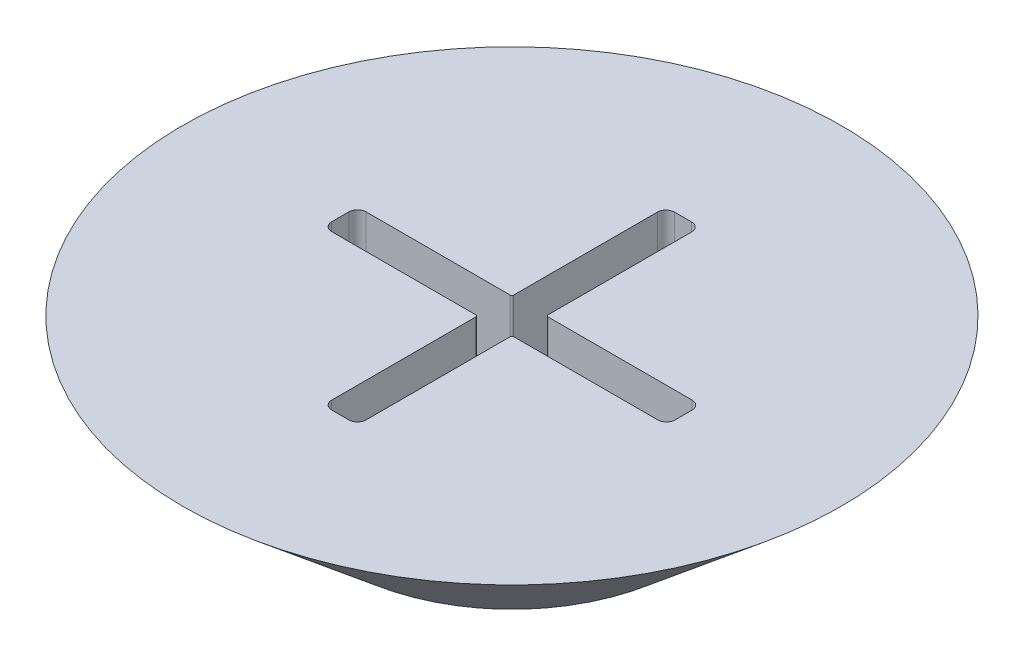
ISO-10303-21;
HEADER;
FILE_DESCRIPTION(('STEP AP214'),'2;1');
FILE_NAME('part.step','',(''),(''),'','','');
FILE_SCHEMA(('AUTOMOTIVE_DESIGN { 1 0 10303 214 1 1 1 1 }'));
ENDSEC;
DATA;
#1=APPLICATION_CONTEXT('core data for automotive mechanical design processes');
#2=APPLICATION_PROTOCOL_DEFINITION('international standard','automotive_design',2000,#1);
#3=PRODUCT_CONTEXT('',#1,'mechanical');
#4=PRODUCT('Part','Part','',(#3));
#5=PRODUCT_RELATED_PRODUCT_CATEGORY('part','',(#4));
#6=PRODUCT_DEFINITION_FORMATION('','',#4);
#7=PRODUCT_DEFINITION_CONTEXT('part definition',#1,'design');
#8=PRODUCT_DEFINITION('design','',#6,#7);
#9=PRODUCT_DEFINITION_SHAPE('','',#8);
#10=(LENGTH_UNIT() NAMED_UNIT(*) SI_UNIT(.MILLI.,.METRE.));
#11=(NAMED_UNIT(*) PLANE_ANGLE_UNIT() SI_UNIT($,.RADIAN.));
#12=(NAMED_UNIT(*) SI_UNIT($,.STERADIAN.) SOLID_ANGLE_UNIT());
#13=UNCERTAINTY_MEASURE_WITH_UNIT(LENGTH_MEASURE(1.E-05),#10,'distance_accuracy_value','');
#14=(GEOMETRIC_REPRESENTATION_CONTEXT(3) GLOBAL_UNCERTAINTY_ASSIGNED_CONTEXT((#13)) GLOBAL_UNIT_ASSIGNED_CONTEXT((#10,
#11,#12)) REPRESENTATION_CONTEXT('',''));
#15=CARTESIAN_POINT('',(0.,0.,0.));
#16=DIRECTION('',(0.,0.,1.));
#17=DIRECTION('',(1.,0.,0.));
#18=AXIS2_PLACEMENT_3D('',#15,#16,#17);
#19=CARTESIAN_POINT('',(-22.2852426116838,14.4740206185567,0.));
#20=DIRECTION('',(0.,1.,0.));
#21=DIRECTION('',(0.,0.,1.));
#22=AXIS2_PLACEMENT_3D('',#19,#20,#21);
#23=PLANE('',#22);
#24=CARTESIAN_POINT('',(-22.2852426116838,14.4740206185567,0.));
#25=DIRECTION('',(0.,1.,0.));
#26=DIRECTION('',(0.,0.,1.));
#27=AXIS2_PLACEMENT_3D('',#24,#25,#26);
#28=CIRCLE('',#27,2.5527);
#29=CARTESIAN_POINT('',(-22.2852426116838,14.4740206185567,2.5527));
#30=VERTEX_POINT('',#29);
#31=EDGE_CURVE('E24',#30,#30,#28,.T.);
#32=ORIENTED_EDGE('',*,*,#31,.F.);
#33=EDGE_LOOP('',(#32));
#34=FACE_BOUND('',#33,.T.);
#35=ADVANCED_FACE('F17',(#34),#23,.F.);
#36=CARTESIAN_POINT('',(-22.2852426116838,16.4298206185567,0.));
#37=DIRECTION('',(0.,-1.,0.));
#38=DIRECTION('',(0.,0.,-1.));
#39=AXIS2_PLACEMENT_3D('',#36,#37,#38);
#40=PLANE('',#39);
#41=DIRECTION('',(0.,0.,1.));
#42=VECTOR('',#41,1.);
#43=CARTESIAN_POINT('',(-22.5392426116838,16.4298206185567,-0.2794));
#44=LINE('',#43,#42);
#45=CARTESIAN_POINT('',(-22.5392426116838,16.4298206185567,-2.40566804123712));
#46=VERTEX_POINT('',#45);
#47=CARTESIAN_POINT('',(-22.5392426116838,16.4298206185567,-0.2794));
#48=VERTEX_POINT('',#47);
#49=EDGE_CURVE('E213',#46,#48,#44,.T.);
#50=ORIENTED_EDGE('',*,*,#49,.F.);
#51=CARTESIAN_POINT('',(-22.4122426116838,16.4298206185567,-2.40566804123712));
#52=DIRECTION('',(0.,1.,0.));
#53=DIRECTION('',(0.,0.,-1.));
#54=AXIS2_PLACEMENT_3D('',#51,#52,#53);
#55=CIRCLE('',#54,0.127);
#56=CARTESIAN_POINT('',(-22.4122426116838,16.4298206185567,-2.53266804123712));
#57=VERTEX_POINT('',#56);
#58=EDGE_CURVE('E31',#57,#46,#55,.T.);
#59=ORIENTED_EDGE('',*,*,#58,.F.);
#60=DIRECTION('',(-1.,0.,0.));
#61=VECTOR('',#60,1.);
#62=CARTESIAN_POINT('',(-22.4122426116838,16.4298206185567,-2.53266804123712));
#63=LINE('',#62,#61);
#64=CARTESIAN_POINT('',(-22.1582426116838,16.4298206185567,-2.53266804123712));
#65=VERTEX_POINT('',#64);
#66=EDGE_CURVE('E276',#65,#57,#63,.T.);
#67=ORIENTED_EDGE('',*,*,#66,.F.);
#68=CARTESIAN_POINT('',(-22.1582426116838,16.4298206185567,-2.40566804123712));
#69=DIRECTION('',(0.,1.,0.));
#70=DIRECTION('',(0.,0.,1.));
#71=AXIS2_PLACEMENT_3D('',#68,#69,#70);
#72=CIRCLE('',#71,0.127);
#73=CARTESIAN_POINT('',(-22.0312426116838,16.4298206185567,-2.40566804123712));
#74=VERTEX_POINT('',#73);
#75=EDGE_CURVE('E274',#74,#65,#72,.T.);
#76=ORIENTED_EDGE('',*,*,#75,.F.);
#77=DIRECTION('',(0.,0.,-1.));
#78=VECTOR('',#77,1.);
#79=CARTESIAN_POINT('',(-22.0312426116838,16.4298206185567,-0.2794));
#80=LINE('',#79,#78);
#81=CARTESIAN_POINT('',(-22.0312426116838,16.4298206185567,-0.2794));
#82=VERTEX_POINT('',#81);
#83=EDGE_CURVE('E187',#82,#74,#80,.T.);
#84=ORIENTED_EDGE('',*,*,#83,.F.);
#85=CARTESIAN_POINT('',(-22.0058426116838,16.4298206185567,-0.2794));
#86=DIRECTION('',(0.,-1.,0.));
#87=DIRECTION('',(0.,0.,1.));
#88=AXIS2_PLACEMENT_3D('',#85,#86,#87);
#89=CIRCLE('',#88,0.0253999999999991);
#90=CARTESIAN_POINT('',(-22.0058426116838,16.4298206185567,-0.254));
#91=VERTEX_POINT('',#90);
#92=EDGE_CURVE('E270',#91,#82,#89,.T.);
#93=ORIENTED_EDGE('',*,*,#92,.F.);
#94=DIRECTION('',(-1.,0.,0.));
#95=VECTOR('',#94,1.);
#96=CARTESIAN_POINT('',(-22.0058426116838,16.4298206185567,-0.254));
#97=LINE('',#96,#95);
#98=CARTESIAN_POINT('',(-19.8722426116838,16.4298206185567,-0.254));
#99=VERTEX_POINT('',#98);
#100=EDGE_CURVE('E267',#99,#91,#97,.T.);
#101=ORIENTED_EDGE('',*,*,#100,.F.);
#102=CARTESIAN_POINT('',(-19.8722426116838,16.4298206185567,-0.127));
#103=DIRECTION('',(0.,1.,0.));
#104=DIRECTION('',(0.,0.,-1.));
#105=AXIS2_PLACEMENT_3D('',#102,#103,#104);
#106=CIRCLE('',#105,0.127);
#107=CARTESIAN_POINT('',(-19.7452426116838,16.4298206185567,-0.126999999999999));
#108=VERTEX_POINT('',#107);
#109=EDGE_CURVE('E264',#108,#99,#106,.T.);
#110=ORIENTED_EDGE('',*,*,#109,.F.);
#111=DIRECTION('',(0.,0.,-1.));
#112=VECTOR('',#111,1.);
#113=CARTESIAN_POINT('',(-19.7452426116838,16.4298206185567,-0.126999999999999));
#114=LINE('',#113,#112);
#115=CARTESIAN_POINT('',(-19.7452426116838,16.4298206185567,0.126999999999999));
#116=VERTEX_POINT('',#115);
#117=EDGE_CURVE('E261',#116,#108,#114,.T.);
#118=ORIENTED_EDGE('',*,*,#117,.F.);
#119=CARTESIAN_POINT('',(-19.8722426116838,16.4298206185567,0.127));
#120=DIRECTION('',(0.,1.,0.));
#121=DIRECTION('',(0.,0.,-1.));
#122=AXIS2_PLACEMENT_3D('',#119,#120,#121);
#123=CIRCLE('',#122,0.127);
#124=CARTESIAN_POINT('',(-19.8722426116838,16.4298206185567,0.254));
#125=VERTEX_POINT('',#124);
#126=EDGE_CURVE('E258',#125,#116,#123,.T.);
#127=ORIENTED_EDGE('',*,*,#126,.F.);
#128=DIRECTION('',(1.,0.,0.));
#129=VECTOR('',#128,1.);
#130=CARTESIAN_POINT('',(-22.0058426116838,16.4298206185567,0.254));
#131=LINE('',#130,#129);
#132=CARTESIAN_POINT('',(-22.0058426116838,16.4298206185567,0.254000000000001));
#133=VERTEX_POINT('',#132);
#134=EDGE_CURVE('E255',#133,#125,#131,.T.);
#135=ORIENTED_EDGE('',*,*,#134,.F.);
#136=CARTESIAN_POINT('',(-22.0058426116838,16.4298206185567,0.2794));
#137=DIRECTION('',(0.,-1.,0.));
#138=DIRECTION('',(0.,0.,-1.));
#139=AXIS2_PLACEMENT_3D('',#136,#137,#138);
#140=CIRCLE('',#139,0.025399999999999);
#141=CARTESIAN_POINT('',(-22.0312426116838,16.4298206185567,0.2794));
#142=VERTEX_POINT('',#141);
#143=EDGE_CURVE('E252',#142,#133,#140,.T.);
#144=ORIENTED_EDGE('',*,*,#143,.F.);
#145=DIRECTION('',(0.,0.,-1.));
#146=VECTOR('',#145,1.);
#147=CARTESIAN_POINT('',(-22.0312426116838,16.4298206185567,0.2794));
#148=LINE('',#147,#146);
#149=CARTESIAN_POINT('',(-22.0312426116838,16.4298206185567,2.413));
#150=VERTEX_POINT('',#149);
#151=EDGE_CURVE('E249',#150,#142,#148,.T.);
#152=ORIENTED_EDGE('',*,*,#151,.F.);
#153=CARTESIAN_POINT('',(-22.1582426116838,16.4298206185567,2.413));
#154=DIRECTION('',(0.,1.,0.));
#155=DIRECTION('',(0.,0.,-1.));
#156=AXIS2_PLACEMENT_3D('',#153,#154,#155);
#157=CIRCLE('',#156,0.126999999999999);
#158=CARTESIAN_POINT('',(-22.1582426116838,16.4298206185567,2.54));
#159=VERTEX_POINT('',#158);
#160=EDGE_CURVE('E246',#159,#150,#157,.T.);
#161=ORIENTED_EDGE('',*,*,#160,.F.);
#162=DIRECTION('',(1.,0.,0.));
#163=VECTOR('',#162,1.);
#164=CARTESIAN_POINT('',(-22.4122426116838,16.4298206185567,2.54));
#165=LINE('',#164,#163);
#166=CARTESIAN_POINT('',(-22.4122426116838,16.4298206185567,2.54));
#167=VERTEX_POINT('',#166);
#168=EDGE_CURVE('E243',#167,#159,#165,.T.);
#169=ORIENTED_EDGE('',*,*,#168,.F.);
#170=CARTESIAN_POINT('',(-22.4122426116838,16.4298206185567,2.413));
#171=DIRECTION('',(0.,1.,0.));
#172=DIRECTION('',(0.,0.,-1.));
#173=AXIS2_PLACEMENT_3D('',#170,#171,#172);
#174=CIRCLE('',#173,0.126999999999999);
#175=CARTESIAN_POINT('',(-22.5392426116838,16.4298206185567,2.413));
#176=VERTEX_POINT('',#175);
#177=EDGE_CURVE('E240',#176,#167,#174,.T.);
#178=ORIENTED_EDGE('',*,*,#177,.F.);
#179=DIRECTION('',(0.,0.,1.));
#180=VECTOR('',#179,1.);
#181=CARTESIAN_POINT('',(-22.5392426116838,16.4298206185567,0.2794));
#182=LINE('',#181,#180);
#183=CARTESIAN_POINT('',(-22.5392426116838,16.4298206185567,0.2794));
#184=VERTEX_POINT('',#183);
#185=EDGE_CURVE('E237',#184,#176,#182,.T.);
#186=ORIENTED_EDGE('',*,*,#185,.F.);
#187=CARTESIAN_POINT('',(-22.5646426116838,16.4298206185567,0.2794));
#188=DIRECTION('',(0.,-1.,0.));
#189=DIRECTION('',(0.,0.,-1.));
#190=AXIS2_PLACEMENT_3D('',#187,#188,#189);
#191=CIRCLE('',#190,0.025399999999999);
#192=CARTESIAN_POINT('',(-22.5646426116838,16.4298206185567,0.254));
#193=VERTEX_POINT('',#192);
#194=EDGE_CURVE('E234',#193,#184,#191,.T.);
#195=ORIENTED_EDGE('',*,*,#194,.F.);
#196=DIRECTION('',(1.,0.,0.));
#197=VECTOR('',#196,1.);
#198=CARTESIAN_POINT('',(-22.5646426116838,16.4298206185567,0.254));
#199=LINE('',#198,#197);
#200=CARTESIAN_POINT('',(-24.6982426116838,16.4298206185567,0.253999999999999));
#201=VERTEX_POINT('',#200);
#202=EDGE_CURVE('E231',#201,#193,#199,.T.);
#203=ORIENTED_EDGE('',*,*,#202,.F.);
#204=CARTESIAN_POINT('',(-24.6982426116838,16.4298206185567,0.127));
#205=DIRECTION('',(0.,1.,0.));
#206=DIRECTION('',(0.,0.,-1.));
#207=AXIS2_PLACEMENT_3D('',#204,#205,#206);
#208=CIRCLE('',#207,0.127);
#209=CARTESIAN_POINT('',(-24.8252426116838,16.4298206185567,0.126999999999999));
#210=VERTEX_POINT('',#209);
#211=EDGE_CURVE('E228',#210,#201,#208,.T.);
#212=ORIENTED_EDGE('',*,*,#211,.F.);
#213=DIRECTION('',(0.,0.,1.));
#214=VECTOR('',#213,1.);
#215=CARTESIAN_POINT('',(-24.8252426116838,16.4298206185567,-0.126999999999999));
#216=LINE('',#215,#214);
#217=CARTESIAN_POINT('',(-24.8252426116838,16.4298206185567,-0.126999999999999));
#218=VERTEX_POINT('',#217);
#219=EDGE_CURVE('E225',#218,#210,#216,.T.);
#220=ORIENTED_EDGE('',*,*,#219,.F.);
#221=CARTESIAN_POINT('',(-24.6982426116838,16.4298206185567,-0.127));
#222=DIRECTION('',(0.,1.,0.));
#223=DIRECTION('',(0.,0.,-1.));
#224=AXIS2_PLACEMENT_3D('',#221,#222,#223);
#225=CIRCLE('',#224,0.127);
#226=CARTESIAN_POINT('',(-24.6982426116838,16.4298206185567,-0.254));
#227=VERTEX_POINT('',#226);
#228=EDGE_CURVE('E222',#227,#218,#225,.T.);
#229=ORIENTED_EDGE('',*,*,#228,.F.);
#230=DIRECTION('',(-1.,0.,0.));
#231=VECTOR('',#230,1.);
#232=CARTESIAN_POINT('',(-22.5646426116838,16.4298206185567,-0.254));
#233=LINE('',#232,#231);
#234=CARTESIAN_POINT('',(-22.5646426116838,16.4298206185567,-0.254000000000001));
#235=VERTEX_POINT('',#234);
#236=EDGE_CURVE('E219',#235,#227,#233,.T.);
#237=ORIENTED_EDGE('',*,*,#236,.F.);
#238=CARTESIAN_POINT('',(-22.5646426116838,16.4298206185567,-0.2794));
#239=DIRECTION('',(0.,-1.,0.));
#240=DIRECTION('',(0.,0.,-1.));
#241=AXIS2_PLACEMENT_3D('',#238,#239,#240);
#242=CIRCLE('',#241,0.0253999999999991);
#243=EDGE_CURVE('E216',#48,#235,#242,.T.);
#244=ORIENTED_EDGE('',*,*,#243,.F.);
#245=EDGE_LOOP('',(#50,#59,#67,#76,#84,#93,#101,#110,#118,#127,#135,#144,#152,#161,#169,#178,
#186,#195,#203,#212,#220,#229,#237,#244));
#246=FACE_BOUND('',#245,.T.);
#247=CARTESIAN_POINT('',(-22.2852426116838,16.4298206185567,0.));
#248=DIRECTION('',(0.,1.,0.));
#249=DIRECTION('',(0.,0.,1.));
#250=AXIS2_PLACEMENT_3D('',#247,#248,#249);
#251=CIRCLE('',#250,4.8768);
#252=CARTESIAN_POINT('',(-22.2852426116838,16.4298206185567,4.8768));
#253=VERTEX_POINT('',#252);
#254=EDGE_CURVE('E11',#253,#253,#251,.T.);
#255=ORIENTED_EDGE('',*,*,#254,.T.);
#256=EDGE_LOOP('',(#255));
#257=FACE_BOUND('',#256,.T.);
#258=ADVANCED_FACE('F326',(#246,#257),#40,.F.);
#259=CARTESIAN_POINT('',(-22.2852426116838,14.4740206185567,0.));
#260=DIRECTION('',(0.,1.,0.));
#261=DIRECTION('',(0.,0.,1.));
#262=AXIS2_PLACEMENT_3D('',#259,#260,#261);
#263=CONICAL_SURFACE('',#262,2.5527,0.871240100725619);
#264=ORIENTED_EDGE('',*,*,#254,.F.);
#265=EDGE_LOOP('',(#264));
#266=FACE_BOUND('',#265,.T.);
#267=ORIENTED_EDGE('',*,*,#31,.T.);
#268=EDGE_LOOP('',(#267));
#269=FACE_BOUND('',#268,.T.);
#270=ADVANCED_FACE('F323',(#266,#269),#263,.T.);
#271=CARTESIAN_POINT('',(-22.4122426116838,15.1598206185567,-2.40566804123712));
#272=DIRECTION('',(0.,1.,0.));
#273=DIRECTION('',(0.,0.,1.));
#274=AXIS2_PLACEMENT_3D('',#271,#272,#273);
#275=CYLINDRICAL_SURFACE('',#274,0.127);
#276=ORIENTED_EDGE('',*,*,#58,.T.);
#277=DIRECTION('',(0.,1.,0.));
#278=VECTOR('',#277,1.);
#279=CARTESIAN_POINT('',(-22.5392426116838,15.1598206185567,-2.40566804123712));
#280=LINE('',#279,#278);
#281=CARTESIAN_POINT('',(-22.5392426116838,15.1598206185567,-2.40566804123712));
#282=VERTEX_POINT('',#281);
#283=EDGE_CURVE('E115',#282,#46,#280,.T.);
#284=ORIENTED_EDGE('',*,*,#283,.F.);
#285=CARTESIAN_POINT('',(-22.4122426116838,15.1598206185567,-2.40566804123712));
#286=DIRECTION('',(0.,1.,0.));
#287=DIRECTION('',(0.,0.,-1.));
#288=AXIS2_PLACEMENT_3D('',#285,#286,#287);
#289=CIRCLE('',#288,0.127);
#290=CARTESIAN_POINT('',(-22.4122426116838,15.1598206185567,-2.53266804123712));
#291=VERTEX_POINT('',#290);
#292=EDGE_CURVE('E278',#291,#282,#289,.T.);
#293=ORIENTED_EDGE('',*,*,#292,.F.);
#294=DIRECTION('',(0.,1.,0.));
#295=VECTOR('',#294,1.);
#296=CARTESIAN_POINT('',(-22.4122426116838,15.1598206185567,-2.53266804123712));
#297=LINE('',#296,#295);
#298=EDGE_CURVE('E39',#291,#57,#297,.T.);
#299=ORIENTED_EDGE('',*,*,#298,.T.);
#300=EDGE_LOOP('',(#276,#284,#293,#299));
#301=FACE_BOUND('',#300,.T.);
#302=ADVANCED_FACE('F337',(#301),#275,.F.);
#303=CARTESIAN_POINT('',(-22.4122426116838,15.1598206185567,-2.53266804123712));
#304=DIRECTION('',(0.,0.,-1.));
#305=DIRECTION('',(-1.,0.,0.));
#306=AXIS2_PLACEMENT_3D('',#303,#304,#305);
#307=PLANE('',#306);
#308=ORIENTED_EDGE('',*,*,#66,.T.);
#309=ORIENTED_EDGE('',*,*,#298,.F.);
#310=DIRECTION('',(-1.,0.,0.));
#311=VECTOR('',#310,1.);
#312=CARTESIAN_POINT('',(-22.4122426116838,15.1598206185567,-2.53266804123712));
#313=LINE('',#312,#311);
#314=CARTESIAN_POINT('',(-22.1582426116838,15.1598206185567,-2.53266804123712));
#315=VERTEX_POINT('',#314);
#316=EDGE_CURVE('E199',#315,#291,#313,.T.);
#317=ORIENTED_EDGE('',*,*,#316,.F.);
#318=DIRECTION('',(0.,1.,0.));
#319=VECTOR('',#318,1.);
#320=CARTESIAN_POINT('',(-22.1582426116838,15.1598206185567,-2.53266804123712));
#321=LINE('',#320,#319);
#322=EDGE_CURVE('E191',#315,#65,#321,.T.);
#323=ORIENTED_EDGE('',*,*,#322,.T.);
#324=EDGE_LOOP('',(#308,#309,#317,#323));
#325=FACE_BOUND('',#324,.T.);
#326=ADVANCED_FACE('F345',(#325),#307,.F.);
#327=CARTESIAN_POINT('',(-22.1582426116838,15.1598206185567,-2.40566804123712));
#328=DIRECTION('',(0.,1.,0.));
#329=DIRECTION('',(0.,0.,1.));
#330=AXIS2_PLACEMENT_3D('',#327,#328,#329);
#331=CYLINDRICAL_SURFACE('',#330,0.127);
#332=ORIENTED_EDGE('',*,*,#75,.T.);
#333=ORIENTED_EDGE('',*,*,#322,.F.);
#334=CARTESIAN_POINT('',(-22.1582426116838,15.1598206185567,-2.40566804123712));
#335=DIRECTION('',(0.,1.,0.));
#336=DIRECTION('',(0.,0.,1.));
#337=AXIS2_PLACEMENT_3D('',#334,#335,#336);
#338=CIRCLE('',#337,0.127);
#339=CARTESIAN_POINT('',(-22.0312426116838,15.1598206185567,-2.40566804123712));
#340=VERTEX_POINT('',#339);
#341=EDGE_CURVE('E195',#340,#315,#338,.T.);
#342=ORIENTED_EDGE('',*,*,#341,.F.);
#343=DIRECTION('',(0.,1.,0.));
#344=VECTOR('',#343,1.);
#345=CARTESIAN_POINT('',(-22.0312426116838,15.1598206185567,-2.40566804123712));
#346=LINE('',#345,#344);
#347=EDGE_CURVE('E180',#340,#74,#346,.T.);
#348=ORIENTED_EDGE('',*,*,#347,.T.);
#349=EDGE_LOOP('',(#332,#333,#342,#348));
#350=FACE_BOUND('',#349,.T.);
#351=ADVANCED_FACE('F196',(#350),#331,.F.);
#352=CARTESIAN_POINT('',(-22.0312426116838,15.1598206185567,-0.2794));
#353=DIRECTION('',(1.,0.,0.));
#354=DIRECTION('',(0.,0.,-1.));
#355=AXIS2_PLACEMENT_3D('',#352,#353,#354);
#356=PLANE('',#355);
#357=ORIENTED_EDGE('',*,*,#83,.T.);
#358=ORIENTED_EDGE('',*,*,#347,.F.);
#359=DIRECTION('',(0.,0.,-1.));
#360=VECTOR('',#359,1.);
#361=CARTESIAN_POINT('',(-22.0312426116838,15.1598206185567,-0.2794));
#362=LINE('',#361,#360);
#363=CARTESIAN_POINT('',(-22.0312426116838,15.1598206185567,-0.2794));
#364=VERTEX_POINT('',#363);
#365=EDGE_CURVE('E184',#364,#340,#362,.T.);
#366=ORIENTED_EDGE('',*,*,#365,.F.);
#367=DIRECTION('',(0.,1.,0.));
#368=VECTOR('',#367,1.);
#369=CARTESIAN_POINT('',(-22.0312426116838,15.1598206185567,-0.2794));
#370=LINE('',#369,#368);
#371=EDGE_CURVE('E192',#364,#82,#370,.T.);
#372=ORIENTED_EDGE('',*,*,#371,.T.);
#373=EDGE_LOOP('',(#357,#358,#366,#372));
#374=FACE_BOUND('',#373,.T.);
#375=ADVANCED_FACE('F182',(#374),#356,.F.);
#376=CARTESIAN_POINT('',(-22.0058426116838,15.1598206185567,-0.2794));
#377=DIRECTION('',(0.,1.,0.));
#378=DIRECTION('',(0.,0.,1.));
#379=AXIS2_PLACEMENT_3D('',#376,#377,#378);
#380=CYLINDRICAL_SURFACE('',#379,0.0253999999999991);
#381=ORIENTED_EDGE('',*,*,#92,.T.);
#382=ORIENTED_EDGE('',*,*,#371,.F.);
#383=CARTESIAN_POINT('',(-22.0058426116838,15.1598206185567,-0.2794));
#384=DIRECTION('',(0.,-1.,0.));
#385=DIRECTION('',(0.,0.,1.));
#386=AXIS2_PLACEMENT_3D('',#383,#384,#385);
#387=CIRCLE('',#386,0.0253999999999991);
#388=CARTESIAN_POINT('',(-22.0058426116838,15.1598206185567,-0.254));
#389=VERTEX_POINT('',#388);
#390=EDGE_CURVE('E205',#389,#364,#387,.T.);
#391=ORIENTED_EDGE('',*,*,#390,.F.);
#392=DIRECTION('',(0.,1.,0.));
#393=VECTOR('',#392,1.);
#394=CARTESIAN_POINT('',(-22.0058426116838,15.1598206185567,-0.254));
#395=LINE('',#394,#393);
#396=EDGE_CURVE('E282',#389,#91,#395,.T.);
#397=ORIENTED_EDGE('',*,*,#396,.T.);
#398=EDGE_LOOP('',(#381,#382,#391,#397));
#399=FACE_BOUND('',#398,.T.);
#400=ADVANCED_FACE('F421',(#399),#380,.T.);
#401=CARTESIAN_POINT('',(-22.0058426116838,15.1598206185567,-0.254));
#402=DIRECTION('',(0.,0.,-1.));
#403=DIRECTION('',(-1.,0.,0.));
#404=AXIS2_PLACEMENT_3D('',#401,#402,#403);
#405=PLANE('',#404);
#406=ORIENTED_EDGE('',*,*,#100,.T.);
#407=ORIENTED_EDGE('',*,*,#396,.F.);
#408=DIRECTION('',(-1.,0.,0.));
#409=VECTOR('',#408,1.);
#410=CARTESIAN_POINT('',(-22.0058426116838,15.1598206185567,-0.254));
#411=LINE('',#410,#409);
#412=CARTESIAN_POINT('',(-19.8722426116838,15.1598206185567,-0.254));
#413=VERTEX_POINT('',#412);
#414=EDGE_CURVE('E207',#413,#389,#411,.T.);
#415=ORIENTED_EDGE('',*,*,#414,.F.);
#416=DIRECTION('',(0.,1.,0.));
#417=VECTOR('',#416,1.);
#418=CARTESIAN_POINT('',(-19.8722426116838,15.1598206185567,-0.254));
#419=LINE('',#418,#417);
#420=EDGE_CURVE('E284',#413,#99,#419,.T.);
#421=ORIENTED_EDGE('',*,*,#420,.T.);
#422=EDGE_LOOP('',(#406,#407,#415,#421));
#423=FACE_BOUND('',#422,.T.);
#424=ADVANCED_FACE('F417',(#423),#405,.F.);
#425=CARTESIAN_POINT('',(-19.8722426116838,15.1598206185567,-0.127));
#426=DIRECTION('',(0.,1.,0.));
#427=DIRECTION('',(0.,0.,1.));
#428=AXIS2_PLACEMENT_3D('',#425,#426,#427);
#429=CYLINDRICAL_SURFACE('',#428,0.127);
#430=ORIENTED_EDGE('',*,*,#109,.T.);
#431=ORIENTED_EDGE('',*,*,#420,.F.);
#432=CARTESIAN_POINT('',(-19.8722426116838,15.1598206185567,-0.127));
#433=DIRECTION('',(0.,1.,0.));
#434=DIRECTION('',(0.,0.,-1.));
#435=AXIS2_PLACEMENT_3D('',#432,#433,#434);
#436=CIRCLE('',#435,0.127);
#437=CARTESIAN_POINT('',(-19.7452426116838,15.1598206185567,-0.126999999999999));
#438=VERTEX_POINT('',#437);
#439=EDGE_CURVE('E659',#438,#413,#436,.T.);
#440=ORIENTED_EDGE('',*,*,#439,.F.);
#441=DIRECTION('',(0.,1.,0.));
#442=VECTOR('',#441,1.);
#443=CARTESIAN_POINT('',(-19.7452426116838,15.1598206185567,-0.126999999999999));
#444=LINE('',#443,#442);
#445=EDGE_CURVE('E286',#438,#108,#444,.T.);
#446=ORIENTED_EDGE('',*,*,#445,.T.);
#447=EDGE_LOOP('',(#430,#431,#440,#446));
#448=FACE_BOUND('',#447,.T.);
#449=ADVANCED_FACE('F413',(#448),#429,.F.);
#450=CARTESIAN_POINT('',(-19.7452426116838,15.1598206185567,-0.126999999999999));
#451=DIRECTION('',(1.,0.,0.));
#452=DIRECTION('',(0.,0.,-1.));
#453=AXIS2_PLACEMENT_3D('',#450,#451,#452);
#454=PLANE('',#453);
#455=ORIENTED_EDGE('',*,*,#117,.T.);
#456=ORIENTED_EDGE('',*,*,#445,.F.);
#457=DIRECTION('',(0.,0.,-1.));
#458=VECTOR('',#457,1.);
#459=CARTESIAN_POINT('',(-19.7452426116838,15.1598206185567,-0.126999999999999));
#460=LINE('',#459,#458);
#461=CARTESIAN_POINT('',(-19.7452426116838,15.1598206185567,0.126999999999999));
#462=VERTEX_POINT('',#461);
#463=EDGE_CURVE('E656',#462,#438,#460,.T.);
#464=ORIENTED_EDGE('',*,*,#463,.F.);
#465=DIRECTION('',(0.,1.,0.));
#466=VECTOR('',#465,1.);
#467=CARTESIAN_POINT('',(-19.7452426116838,15.1598206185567,0.126999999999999));
#468=LINE('',#467,#466);
#469=EDGE_CURVE('E288',#462,#116,#468,.T.);
#470=ORIENTED_EDGE('',*,*,#469,.T.);
#471=EDGE_LOOP('',(#455,#456,#464,#470));
#472=FACE_BOUND('',#471,.T.);
#473=ADVANCED_FACE('F409',(#472),#454,.F.);
#474=CARTESIAN_POINT('',(-19.8722426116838,15.1598206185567,0.127));
#475=DIRECTION('',(0.,1.,0.));
#476=DIRECTION('',(0.,0.,1.));
#477=AXIS2_PLACEMENT_3D('',#474,#475,#476);
#478=CYLINDRICAL_SURFACE('',#477,0.127);
#479=ORIENTED_EDGE('',*,*,#126,.T.);
#480=ORIENTED_EDGE('',*,*,#469,.F.);
#481=CARTESIAN_POINT('',(-19.8722426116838,15.1598206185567,0.127));
#482=DIRECTION('',(0.,1.,0.));
#483=DIRECTION('',(0.,0.,-1.));
#484=AXIS2_PLACEMENT_3D('',#481,#482,#483);
#485=CIRCLE('',#484,0.127);
#486=CARTESIAN_POINT('',(-19.8722426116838,15.1598206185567,0.254));
#487=VERTEX_POINT('',#486);
#488=EDGE_CURVE('E653',#487,#462,#485,.T.);
#489=ORIENTED_EDGE('',*,*,#488,.F.);
#490=DIRECTION('',(0.,1.,0.));
#491=VECTOR('',#490,1.);
#492=CARTESIAN_POINT('',(-19.8722426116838,15.1598206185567,0.254));
#493=LINE('',#492,#491);
#494=EDGE_CURVE('E290',#487,#125,#493,.T.);
#495=ORIENTED_EDGE('',*,*,#494,.T.);
#496=EDGE_LOOP('',(#479,#480,#489,#495));
#497=FACE_BOUND('',#496,.T.);
#498=ADVANCED_FACE('F405',(#497),#478,.F.);
#499=CARTESIAN_POINT('',(-22.0058426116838,15.1598206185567,0.254));
#500=DIRECTION('',(0.,0.,1.));
#501=DIRECTION('',(1.,0.,0.));
#502=AXIS2_PLACEMENT_3D('',#499,#500,#501);
#503=PLANE('',#502);
#504=ORIENTED_EDGE('',*,*,#134,.T.);
#505=ORIENTED_EDGE('',*,*,#494,.F.);
#506=DIRECTION('',(1.,0.,0.));
#507=VECTOR('',#506,1.);
#508=CARTESIAN_POINT('',(-22.0058426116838,15.1598206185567,0.254));
#509=LINE('',#508,#507);
#510=CARTESIAN_POINT('',(-22.0058426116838,15.1598206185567,0.254000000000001));
#511=VERTEX_POINT('',#510);
#512=EDGE_CURVE('E650',#511,#487,#509,.T.);
#513=ORIENTED_EDGE('',*,*,#512,.F.);
#514=DIRECTION('',(0.,1.,0.));
#515=VECTOR('',#514,1.);
#516=CARTESIAN_POINT('',(-22.0058426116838,15.1598206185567,0.254000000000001));
#517=LINE('',#516,#515);
#518=EDGE_CURVE('E292',#511,#133,#517,.T.);
#519=ORIENTED_EDGE('',*,*,#518,.T.);
#520=EDGE_LOOP('',(#504,#505,#513,#519));
#521=FACE_BOUND('',#520,.T.);
#522=ADVANCED_FACE('F401',(#521),#503,.F.);
#523=CARTESIAN_POINT('',(-22.0058426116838,15.1598206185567,0.2794));
#524=DIRECTION('',(0.,1.,0.));
#525=DIRECTION('',(0.,0.,1.));
#526=AXIS2_PLACEMENT_3D('',#523,#524,#525);
#527=CYLINDRICAL_SURFACE('',#526,0.025399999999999);
#528=ORIENTED_EDGE('',*,*,#143,.T.);
#529=ORIENTED_EDGE('',*,*,#518,.F.);
#530=CARTESIAN_POINT('',(-22.0058426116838,15.1598206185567,0.2794));
#531=DIRECTION('',(0.,-1.,0.));
#532=DIRECTION('',(0.,0.,-1.));
#533=AXIS2_PLACEMENT_3D('',#530,#531,#532);
#534=CIRCLE('',#533,0.025399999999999);
#535=CARTESIAN_POINT('',(-22.0312426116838,15.1598206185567,0.2794));
#536=VERTEX_POINT('',#535);
#537=EDGE_CURVE('E647',#536,#511,#534,.T.);
#538=ORIENTED_EDGE('',*,*,#537,.F.);
#539=DIRECTION('',(0.,1.,0.));
#540=VECTOR('',#539,1.);
#541=CARTESIAN_POINT('',(-22.0312426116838,15.1598206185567,0.2794));
#542=LINE('',#541,#540);
#543=EDGE_CURVE('E294',#536,#142,#542,.T.);
#544=ORIENTED_EDGE('',*,*,#543,.T.);
#545=EDGE_LOOP('',(#528,#529,#538,#544));
#546=FACE_BOUND('',#545,.T.);
#547=ADVANCED_FACE('F397',(#546),#527,.T.);
#548=CARTESIAN_POINT('',(-22.0312426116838,15.1598206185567,0.2794));
#549=DIRECTION('',(1.,0.,0.));
#550=DIRECTION('',(0.,0.,-1.));
#551=AXIS2_PLACEMENT_3D('',#548,#549,#550);
#552=PLANE('',#551);
#553=ORIENTED_EDGE('',*,*,#151,.T.);
#554=ORIENTED_EDGE('',*,*,#543,.F.);
#555=DIRECTION('',(0.,0.,-1.));
#556=VECTOR('',#555,1.);
#557=CARTESIAN_POINT('',(-22.0312426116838,15.1598206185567,0.2794));
#558=LINE('',#557,#556);
#559=CARTESIAN_POINT('',(-22.0312426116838,15.1598206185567,2.413));
#560=VERTEX_POINT('',#559);
#561=EDGE_CURVE('E644',#560,#536,#558,.T.);
#562=ORIENTED_EDGE('',*,*,#561,.F.);
#563=DIRECTION('',(0.,1.,0.));
#564=VECTOR('',#563,1.);
#565=CARTESIAN_POINT('',(-22.0312426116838,15.1598206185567,2.413));
#566=LINE('',#565,#564);
#567=EDGE_CURVE('E296',#560,#150,#566,.T.);
#568=ORIENTED_EDGE('',*,*,#567,.T.);
#569=EDGE_LOOP('',(#553,#554,#562,#568));
#570=FACE_BOUND('',#569,.T.);
#571=ADVANCED_FACE('F393',(#570),#552,.F.);
#572=CARTESIAN_POINT('',(-22.1582426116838,15.1598206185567,2.413));
#573=DIRECTION('',(0.,1.,0.));
#574=DIRECTION('',(0.,0.,1.));
#575=AXIS2_PLACEMENT_3D('',#572,#573,#574);
#576=CYLINDRICAL_SURFACE('',#575,0.126999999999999);
#577=ORIENTED_EDGE('',*,*,#160,.T.);
#578=ORIENTED_EDGE('',*,*,#567,.F.);
#579=CARTESIAN_POINT('',(-22.1582426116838,15.1598206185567,2.413));
#580=DIRECTION('',(0.,1.,0.));
#581=DIRECTION('',(0.,0.,-1.));
#582=AXIS2_PLACEMENT_3D('',#579,#580,#581);
#583=CIRCLE('',#582,0.126999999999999);
#584=CARTESIAN_POINT('',(-22.1582426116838,15.1598206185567,2.54));
#585=VERTEX_POINT('',#584);
#586=EDGE_CURVE('E641',#585,#560,#583,.T.);
#587=ORIENTED_EDGE('',*,*,#586,.F.);
#588=DIRECTION('',(0.,1.,0.));
#589=VECTOR('',#588,1.);
#590=CARTESIAN_POINT('',(-22.1582426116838,15.1598206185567,2.54));
#591=LINE('',#590,#589);
#592=EDGE_CURVE('E298',#585,#159,#591,.T.);
#593=ORIENTED_EDGE('',*,*,#592,.T.);
#594=EDGE_LOOP('',(#577,#578,#587,#593));
#595=FACE_BOUND('',#594,.T.);
#596=ADVANCED_FACE('F389',(#595),#576,.F.);
#597=CARTESIAN_POINT('',(-22.4122426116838,15.1598206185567,2.54));
#598=DIRECTION('',(0.,0.,1.));
#599=DIRECTION('',(1.,0.,0.));
#600=AXIS2_PLACEMENT_3D('',#597,#598,#599);
#601=PLANE('',#600);
#602=ORIENTED_EDGE('',*,*,#168,.T.);
#603=ORIENTED_EDGE('',*,*,#592,.F.);
#604=DIRECTION('',(1.,0.,0.));
#605=VECTOR('',#604,1.);
#606=CARTESIAN_POINT('',(-22.4122426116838,15.1598206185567,2.54));
#607=LINE('',#606,#605);
#608=CARTESIAN_POINT('',(-22.4122426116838,15.1598206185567,2.54));
#609=VERTEX_POINT('',#608);
#610=EDGE_CURVE('E638',#609,#585,#607,.T.);
#611=ORIENTED_EDGE('',*,*,#610,.F.);
#612=DIRECTION('',(0.,1.,0.));
#613=VECTOR('',#612,1.);
#614=CARTESIAN_POINT('',(-22.4122426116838,15.1598206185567,2.54));
#615=LINE('',#614,#613);
#616=EDGE_CURVE('E300',#609,#167,#615,.T.);
#617=ORIENTED_EDGE('',*,*,#616,.T.);
#618=EDGE_LOOP('',(#602,#603,#611,#617));
#619=FACE_BOUND('',#618,.T.);
#620=ADVANCED_FACE('F385',(#619),#601,.F.);
#621=CARTESIAN_POINT('',(-22.4122426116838,15.1598206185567,2.413));
#622=DIRECTION('',(0.,1.,0.));
#623=DIRECTION('',(0.,0.,1.));
#624=AXIS2_PLACEMENT_3D('',#621,#622,#623);
#625=CYLINDRICAL_SURFACE('',#624,0.126999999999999);
#626=ORIENTED_EDGE('',*,*,#177,.T.);
#627=ORIENTED_EDGE('',*,*,#616,.F.);
#628=CARTESIAN_POINT('',(-22.4122426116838,15.1598206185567,2.413));
#629=DIRECTION('',(0.,1.,0.));
#630=DIRECTION('',(0.,0.,-1.));
#631=AXIS2_PLACEMENT_3D('',#628,#629,#630);
#632=CIRCLE('',#631,0.126999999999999);
#633=CARTESIAN_POINT('',(-22.5392426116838,15.1598206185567,2.413));
#634=VERTEX_POINT('',#633);
#635=EDGE_CURVE('E635',#634,#609,#632,.T.);
#636=ORIENTED_EDGE('',*,*,#635,.F.);
#637=DIRECTION('',(0.,1.,0.));
#638=VECTOR('',#637,1.);
#639=CARTESIAN_POINT('',(-22.5392426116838,15.1598206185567,2.413));
#640=LINE('',#639,#638);
#641=EDGE_CURVE('E302',#634,#176,#640,.T.);
#642=ORIENTED_EDGE('',*,*,#641,.T.);
#643=EDGE_LOOP('',(#626,#627,#636,#642));
#644=FACE_BOUND('',#643,.T.);
#645=ADVANCED_FACE('F381',(#644),#625,.F.);
#646=CARTESIAN_POINT('',(-22.5392426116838,15.1598206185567,0.2794));
#647=DIRECTION('',(-1.,0.,0.));
#648=DIRECTION('',(0.,0.,1.));
#649=AXIS2_PLACEMENT_3D('',#646,#647,#648);
#650=PLANE('',#649);
#651=ORIENTED_EDGE('',*,*,#185,.T.);
#652=ORIENTED_EDGE('',*,*,#641,.F.);
#653=DIRECTION('',(0.,0.,1.));
#654=VECTOR('',#653,1.);
#655=CARTESIAN_POINT('',(-22.5392426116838,15.1598206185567,0.2794));
#656=LINE('',#655,#654);
#657=CARTESIAN_POINT('',(-22.5392426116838,15.1598206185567,0.2794));
#658=VERTEX_POINT('',#657);
#659=EDGE_CURVE('E632',#658,#634,#656,.T.);
#660=ORIENTED_EDGE('',*,*,#659,.F.);
#661=DIRECTION('',(0.,1.,0.));
#662=VECTOR('',#661,1.);
#663=CARTESIAN_POINT('',(-22.5392426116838,15.1598206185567,0.2794));
#664=LINE('',#663,#662);
#665=EDGE_CURVE('E304',#658,#184,#664,.T.);
#666=ORIENTED_EDGE('',*,*,#665,.T.);
#667=EDGE_LOOP('',(#651,#652,#660,#666));
#668=FACE_BOUND('',#667,.T.);
#669=ADVANCED_FACE('F377',(#668),#650,.F.);
#670=CARTESIAN_POINT('',(-22.5646426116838,15.1598206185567,0.2794));
#671=DIRECTION('',(0.,1.,0.));
#672=DIRECTION('',(0.,0.,1.));
#673=AXIS2_PLACEMENT_3D('',#670,#671,#672);
#674=CYLINDRICAL_SURFACE('',#673,0.025399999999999);
#675=ORIENTED_EDGE('',*,*,#194,.T.);
#676=ORIENTED_EDGE('',*,*,#665,.F.);
#677=CARTESIAN_POINT('',(-22.5646426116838,15.1598206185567,0.2794));
#678=DIRECTION('',(0.,-1.,0.));
#679=DIRECTION('',(0.,0.,-1.));
#680=AXIS2_PLACEMENT_3D('',#677,#678,#679);
#681=CIRCLE('',#680,0.025399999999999);
#682=CARTESIAN_POINT('',(-22.5646426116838,15.1598206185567,0.254));
#683=VERTEX_POINT('',#682);
#684=EDGE_CURVE('E629',#683,#658,#681,.T.);
#685=ORIENTED_EDGE('',*,*,#684,.F.);
#686=DIRECTION('',(0.,1.,0.));
#687=VECTOR('',#686,1.);
#688=CARTESIAN_POINT('',(-22.5646426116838,15.1598206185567,0.254));
#689=LINE('',#688,#687);
#690=EDGE_CURVE('E306',#683,#193,#689,.T.);
#691=ORIENTED_EDGE('',*,*,#690,.T.);
#692=EDGE_LOOP('',(#675,#676,#685,#691));
#693=FACE_BOUND('',#692,.T.);
#694=ADVANCED_FACE('F373',(#693),#674,.T.);
#695=CARTESIAN_POINT('',(-22.5646426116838,15.1598206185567,0.254));
#696=DIRECTION('',(0.,0.,1.));
#697=DIRECTION('',(1.,0.,0.));
#698=AXIS2_PLACEMENT_3D('',#695,#696,#697);
#699=PLANE('',#698);
#700=ORIENTED_EDGE('',*,*,#202,.T.);
#701=ORIENTED_EDGE('',*,*,#690,.F.);
#702=DIRECTION('',(1.,0.,0.));
#703=VECTOR('',#702,1.);
#704=CARTESIAN_POINT('',(-22.5646426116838,15.1598206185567,0.254));
#705=LINE('',#704,#703);
#706=CARTESIAN_POINT('',(-24.6982426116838,15.1598206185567,0.253999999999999));
#707=VERTEX_POINT('',#706);
#708=EDGE_CURVE('E626',#707,#683,#705,.T.);
#709=ORIENTED_EDGE('',*,*,#708,.F.);
#710=DIRECTION('',(0.,1.,0.));
#711=VECTOR('',#710,1.);
#712=CARTESIAN_POINT('',(-24.6982426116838,15.1598206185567,0.253999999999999));
#713=LINE('',#712,#711);
#714=EDGE_CURVE('E308',#707,#201,#713,.T.);
#715=ORIENTED_EDGE('',*,*,#714,.T.);
#716=EDGE_LOOP('',(#700,#701,#709,#715));
#717=FACE_BOUND('',#716,.T.);
#718=ADVANCED_FACE('F369',(#717),#699,.F.);
#719=CARTESIAN_POINT('',(-24.6982426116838,15.1598206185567,0.127));
#720=DIRECTION('',(0.,1.,0.));
#721=DIRECTION('',(0.,0.,1.));
#722=AXIS2_PLACEMENT_3D('',#719,#720,#721);
#723=CYLINDRICAL_SURFACE('',#722,0.127);
#724=ORIENTED_EDGE('',*,*,#211,.T.);
#725=ORIENTED_EDGE('',*,*,#714,.F.);
#726=CARTESIAN_POINT('',(-24.6982426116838,15.1598206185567,0.127));
#727=DIRECTION('',(0.,1.,0.));
#728=DIRECTION('',(0.,0.,-1.));
#729=AXIS2_PLACEMENT_3D('',#726,#727,#728);
#730=CIRCLE('',#729,0.127);
#731=CARTESIAN_POINT('',(-24.8252426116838,15.1598206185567,0.126999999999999));
#732=VERTEX_POINT('',#731);
#733=EDGE_CURVE('E623',#732,#707,#730,.T.);
#734=ORIENTED_EDGE('',*,*,#733,.F.);
#735=DIRECTION('',(0.,1.,0.));
#736=VECTOR('',#735,1.);
#737=CARTESIAN_POINT('',(-24.8252426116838,15.1598206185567,0.126999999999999));
#738=LINE('',#737,#736);
#739=EDGE_CURVE('E310',#732,#210,#738,.T.);
#740=ORIENTED_EDGE('',*,*,#739,.T.);
#741=EDGE_LOOP('',(#724,#725,#734,#740));
#742=FACE_BOUND('',#741,.T.);
#743=ADVANCED_FACE('F365',(#742),#723,.F.);
#744=CARTESIAN_POINT('',(-24.8252426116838,15.1598206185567,-0.126999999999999));
#745=DIRECTION('',(-1.,0.,0.));
#746=DIRECTION('',(0.,0.,1.));
#747=AXIS2_PLACEMENT_3D('',#744,#745,#746);
#748=PLANE('',#747);
#749=ORIENTED_EDGE('',*,*,#219,.T.);
#750=ORIENTED_EDGE('',*,*,#739,.F.);
#751=DIRECTION('',(0.,0.,1.));
#752=VECTOR('',#751,1.);
#753=CARTESIAN_POINT('',(-24.8252426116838,15.1598206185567,-0.126999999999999));
#754=LINE('',#753,#752);
#755=CARTESIAN_POINT('',(-24.8252426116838,15.1598206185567,-0.126999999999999));
#756=VERTEX_POINT('',#755);
#757=EDGE_CURVE('E620',#756,#732,#754,.T.);
#758=ORIENTED_EDGE('',*,*,#757,.F.);
#759=DIRECTION('',(0.,1.,0.));
#760=VECTOR('',#759,1.);
#761=CARTESIAN_POINT('',(-24.8252426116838,15.1598206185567,-0.126999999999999));
#762=LINE('',#761,#760);
#763=EDGE_CURVE('E312',#756,#218,#762,.T.);
#764=ORIENTED_EDGE('',*,*,#763,.T.);
#765=EDGE_LOOP('',(#749,#750,#758,#764));
#766=FACE_BOUND('',#765,.T.);
#767=ADVANCED_FACE('F361',(#766),#748,.F.);
#768=CARTESIAN_POINT('',(-24.6982426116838,15.1598206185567,-0.127));
#769=DIRECTION('',(0.,1.,0.));
#770=DIRECTION('',(0.,0.,1.));
#771=AXIS2_PLACEMENT_3D('',#768,#769,#770);
#772=CYLINDRICAL_SURFACE('',#771,0.127);
#773=ORIENTED_EDGE('',*,*,#228,.T.);
#774=ORIENTED_EDGE('',*,*,#763,.F.);
#775=CARTESIAN_POINT('',(-24.6982426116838,15.1598206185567,-0.127));
#776=DIRECTION('',(0.,1.,0.));
#777=DIRECTION('',(0.,0.,-1.));
#778=AXIS2_PLACEMENT_3D('',#775,#776,#777);
#779=CIRCLE('',#778,0.127);
#780=CARTESIAN_POINT('',(-24.6982426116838,15.1598206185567,-0.254));
#781=VERTEX_POINT('',#780);
#782=EDGE_CURVE('E617',#781,#756,#779,.T.);
#783=ORIENTED_EDGE('',*,*,#782,.F.);
#784=DIRECTION('',(0.,1.,0.));
#785=VECTOR('',#784,1.);
#786=CARTESIAN_POINT('',(-24.6982426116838,15.1598206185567,-0.254));
#787=LINE('',#786,#785);
#788=EDGE_CURVE('E314',#781,#227,#787,.T.);
#789=ORIENTED_EDGE('',*,*,#788,.T.);
#790=EDGE_LOOP('',(#773,#774,#783,#789));
#791=FACE_BOUND('',#790,.T.);
#792=ADVANCED_FACE('F357',(#791),#772,.F.);
#793=CARTESIAN_POINT('',(-22.5646426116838,15.1598206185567,-0.254));
#794=DIRECTION('',(0.,0.,-1.));
#795=DIRECTION('',(-1.,0.,0.));
#796=AXIS2_PLACEMENT_3D('',#793,#794,#795);
#797=PLANE('',#796);
#798=ORIENTED_EDGE('',*,*,#236,.T.);
#799=ORIENTED_EDGE('',*,*,#788,.F.);
#800=DIRECTION('',(-1.,0.,0.));
#801=VECTOR('',#800,1.);
#802=CARTESIAN_POINT('',(-22.5646426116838,15.1598206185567,-0.254));
#803=LINE('',#802,#801);
#804=CARTESIAN_POINT('',(-22.5646426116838,15.1598206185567,-0.254000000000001));
#805=VERTEX_POINT('',#804);
#806=EDGE_CURVE('E614',#805,#781,#803,.T.);
#807=ORIENTED_EDGE('',*,*,#806,.F.);
#808=DIRECTION('',(0.,1.,0.));
#809=VECTOR('',#808,1.);
#810=CARTESIAN_POINT('',(-22.5646426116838,15.1598206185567,-0.254000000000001));
#811=LINE('',#810,#809);
#812=EDGE_CURVE('E316',#805,#235,#811,.T.);
#813=ORIENTED_EDGE('',*,*,#812,.T.);
#814=EDGE_LOOP('',(#798,#799,#807,#813));
#815=FACE_BOUND('',#814,.T.);
#816=ADVANCED_FACE('F353',(#815),#797,.F.);
#817=CARTESIAN_POINT('',(-22.5646426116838,15.1598206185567,-0.2794));
#818=DIRECTION('',(0.,1.,0.));
#819=DIRECTION('',(0.,0.,1.));
#820=AXIS2_PLACEMENT_3D('',#817,#818,#819);
#821=CYLINDRICAL_SURFACE('',#820,0.0253999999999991);
#822=ORIENTED_EDGE('',*,*,#243,.T.);
#823=ORIENTED_EDGE('',*,*,#812,.F.);
#824=CARTESIAN_POINT('',(-22.5646426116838,15.1598206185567,-0.2794));
#825=DIRECTION('',(0.,-1.,0.));
#826=DIRECTION('',(0.,0.,-1.));
#827=AXIS2_PLACEMENT_3D('',#824,#825,#826);
#828=CIRCLE('',#827,0.0253999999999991);
#829=CARTESIAN_POINT('',(-22.5392426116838,15.1598206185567,-0.2794));
#830=VERTEX_POINT('',#829);
#831=EDGE_CURVE('E609',#830,#805,#828,.T.);
#832=ORIENTED_EDGE('',*,*,#831,.F.);
#833=DIRECTION('',(0.,1.,0.));
#834=VECTOR('',#833,1.);
#835=CARTESIAN_POINT('',(-22.5392426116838,15.1598206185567,-0.2794));
#836=LINE('',#835,#834);
#837=EDGE_CURVE('E318',#830,#48,#836,.T.);
#838=ORIENTED_EDGE('',*,*,#837,.T.);
#839=EDGE_LOOP('',(#822,#823,#832,#838));
#840=FACE_BOUND('',#839,.T.);
#841=ADVANCED_FACE('F349',(#840),#821,.T.);
#842=CARTESIAN_POINT('',(-22.5392426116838,15.1598206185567,-0.2794));
#843=DIRECTION('',(-1.,0.,0.));
#844=DIRECTION('',(0.,0.,1.));
#845=AXIS2_PLACEMENT_3D('',#842,#843,#844);
#846=PLANE('',#845);
#847=ORIENTED_EDGE('',*,*,#49,.T.);
#848=ORIENTED_EDGE('',*,*,#837,.F.);
#849=DIRECTION('',(0.,0.,1.));
#850=VECTOR('',#849,1.);
#851=CARTESIAN_POINT('',(-22.5392426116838,15.1598206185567,-0.2794));
#852=LINE('',#851,#850);
#853=EDGE_CURVE('E607',#282,#830,#852,.T.);
#854=ORIENTED_EDGE('',*,*,#853,.F.);
#855=ORIENTED_EDGE('',*,*,#283,.T.);
#856=EDGE_LOOP('',(#847,#848,#854,#855));
#857=FACE_BOUND('',#856,.T.);
#858=ADVANCED_FACE('F346',(#857),#846,.F.);
#859=CARTESIAN_POINT('',(-22.4122426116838,15.1598206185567,-2.40566804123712));
#860=DIRECTION('',(0.,-1.,0.));
#861=DIRECTION('',(0.,0.,-1.));
#862=AXIS2_PLACEMENT_3D('',#859,#860,#861);
#863=PLANE('',#862);
#864=ORIENTED_EDGE('',*,*,#292,.T.);
#865=ORIENTED_EDGE('',*,*,#853,.T.);
#866=ORIENTED_EDGE('',*,*,#831,.T.);
#867=ORIENTED_EDGE('',*,*,#806,.T.);
#868=ORIENTED_EDGE('',*,*,#782,.T.);
#869=ORIENTED_EDGE('',*,*,#757,.T.);
#870=ORIENTED_EDGE('',*,*,#733,.T.);
#871=ORIENTED_EDGE('',*,*,#708,.T.);
#872=ORIENTED_EDGE('',*,*,#684,.T.);
#873=ORIENTED_EDGE('',*,*,#659,.T.);
#874=ORIENTED_EDGE('',*,*,#635,.T.);
#875=ORIENTED_EDGE('',*,*,#610,.T.);
#876=ORIENTED_EDGE('',*,*,#586,.T.);
#877=ORIENTED_EDGE('',*,*,#561,.T.);
#878=ORIENTED_EDGE('',*,*,#537,.T.);
#879=ORIENTED_EDGE('',*,*,#512,.T.);
#880=ORIENTED_EDGE('',*,*,#488,.T.);
#881=ORIENTED_EDGE('',*,*,#463,.T.);
#882=ORIENTED_EDGE('',*,*,#439,.T.);
#883=ORIENTED_EDGE('',*,*,#414,.T.);
#884=ORIENTED_EDGE('',*,*,#390,.T.);
#885=ORIENTED_EDGE('',*,*,#365,.T.);
#886=ORIENTED_EDGE('',*,*,#341,.T.);
#887=ORIENTED_EDGE('',*,*,#316,.T.);
#888=EDGE_LOOP('',(#864,#865,#866,#867,#868,#869,#870,#871,#872,#873,#874,#875,#876,#877,#878,
#879,#880,#881,#882,#883,#884,#885,#886,#887));
#889=FACE_BOUND('',#888,.T.);
#890=ADVANCED_FACE('F202',(#889),#863,.F.);
#891=CLOSED_SHELL('',(#35,#258,#270,#302,#326,#351,#375,#400,#424,#449,#473,#498,#522,#547,#571,
#596,#620,#645,#669,#694,#718,#743,#767,#792,#816,#841,#858,#890));
#892=MANIFOLD_SOLID_BREP('B1',#891);
#893=ADVANCED_BREP_SHAPE_REPRESENTATION('',(#18,#892),#14);
#894=SHAPE_DEFINITION_REPRESENTATION(#9,#893);
ENDSEC;
END-ISO-10303-21;
